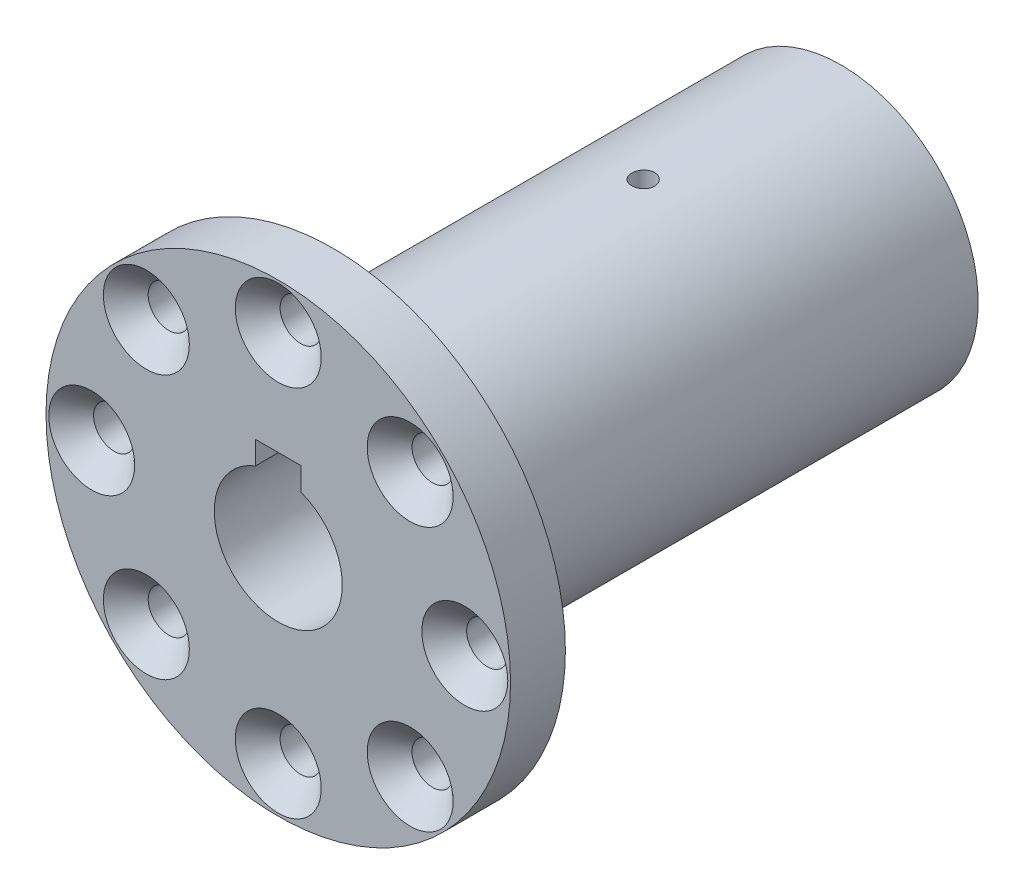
from build123d import *

# Parameters (mm, degrees)
SKETCH1_W                                         = 25.4
SKETCH1_H                                         = 6
SKETCH2_R                                         = 15
BOSS_EXTRUDE1_DEPTH                               = 55.54
CUT_EXTRUDE1_DEPTH                                = 72.256519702
SKETCH4_W                                         = 7
SKETCH4_H                                         = 61.54
F_2_CLEARANCE_HOLE1_D                             = 2.5
F_2_CLEARANCE_HOLE1_DEPTH                         = 12
SKETCH7_W                                         = 1.25
SKETCH7_H                                         = 16.341500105
CSK_FOR_8_FLAT_HEAD_MACHINE_SCREW_100_D           = 4.5
CSK_FOR_8_FLAT_HEAD_MACHINE_SCREW_100_DEPTH       = 61.54
CSK_FOR_8_FLAT_HEAD_MACHINE_SCREW_100_CSINK_D     = 9.4
CSK_FOR_8_FLAT_HEAD_MACHINE_SCREW_100_CSINK_ANGLE = 90


with BuildPart() as part:
    # Sketch1 → Revolve1 (revolve)
    with BuildSketch(Plane.XZ, mode=Mode.PRIVATE) as revolve1_sk:
        with Locations((12.7, 58.54)):
            Rectangle(SKETCH1_W, SKETCH1_H)
    revolve(revolve1_sk.sketch.rotate(Axis((0, 0, 61.54), (0, 0, -1)), 180), axis=Axis((0, 0, 61.54), (0, 0, -1)))

    # Sketch2 → Boss-Extrude1 (add)
    with BuildSketch(Plane(origin=(0, 0, 55.54), x_dir=(-1, 0, 0), z_dir=(0, 0, -1))):
        Circle(SKETCH2_R)
    extrude(amount=BOSS_EXTRUDE1_DEPTH)

    # Sketch3 → Cut-Extrude1 (cut, through all)
    with BuildSketch(Plane(origin=(0, 0, 0), x_dir=(-1, 0, 0), z_dir=(0, 0, -1))):
        with BuildLine():
            Line((2.5, 9.058499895), (-2.5, 9.058499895))
            Line((-2.5, 9.058499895), (-2.5, 6.538348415))
            ThreePointArc((-2.5, 6.538348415), (0, 7), (2.5, 6.538348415))
            Line((2.5, 6.538348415), (2.5, 9.058499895))
        make_face()
    extrude(amount=-CUT_EXTRUDE1_DEPTH, mode=Mode.SUBTRACT)

    # Sketch4 → Cut-Revolve1 (revolve, cut)
    with BuildSketch(Plane.XZ):
        with Locations((3.5, 30.77)):
            Rectangle(SKETCH4_W, SKETCH4_H)
    revolve(axis=Axis((0, 0, 61.54), (0, 0, -1)), mode=Mode.SUBTRACT)

    # 2 Clearance Hole1
    with Locations(Plane(origin=(0, 0, 0), x_dir=(-1, 0, 0), z_dir=(0, 0, -1))):
        with Locations((-11.5, 0), (-5.75, -9.959292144), (5.75, -9.959292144), (11.5, 0), (5.75, 9.959292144), (-5.75, 9.959292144)):
            Hole(F_2_CLEARANCE_HOLE1_D / 2, depth=F_2_CLEARANCE_HOLE1_DEPTH)

    # Sketch7 → 2 Clearance Hole2 (revolve, cut)
    with BuildSketch(Plane(origin=(0, 9.058499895, 21.64), x_dir=(0, 0, -1), z_dir=(1, 0, 0))):
        with Locations((0.625, 8.170750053)):
            Rectangle(SKETCH7_W, SKETCH7_H)
    revolve(axis=Axis((0, 2.708499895, 21.64), (0, 1, 0)), mode=Mode.SUBTRACT)

    # CSK for _8 Flat Head Machine Screw _100
    with Locations(Plane.XY.offset(61.54)):
        with Locations((0, 20.4), (14.424978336, 14.424978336), (20.4, 0), (14.424978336, -14.424978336), (0, -20.4), (-14.424978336, -14.424978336), (-20.4, 0), (-14.424978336, 14.424978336)):
            CounterSinkHole(CSK_FOR_8_FLAT_HEAD_MACHINE_SCREW_100_D / 2, CSK_FOR_8_FLAT_HEAD_MACHINE_SCREW_100_CSINK_D / 2, depth=CSK_FOR_8_FLAT_HEAD_MACHINE_SCREW_100_DEPTH, counter_sink_angle=CSK_FOR_8_FLAT_HEAD_MACHINE_SCREW_100_CSINK_ANGLE)


solid = part.part
